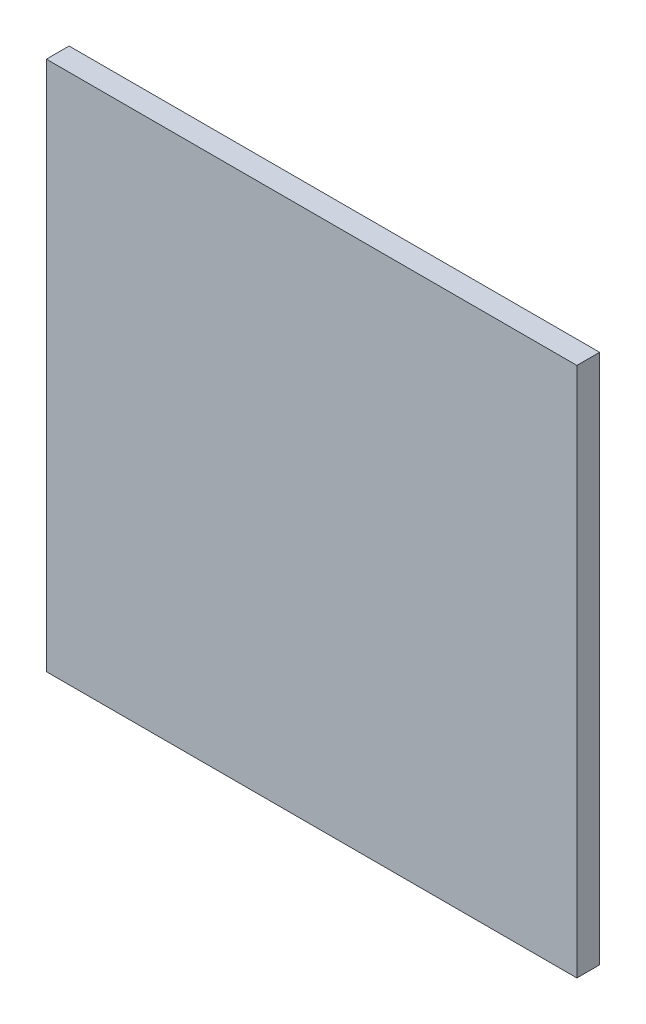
ISO-10303-21;
HEADER;
FILE_DESCRIPTION(('STEP AP214'),'2;1');
FILE_NAME('part.step','',(''),(''),'','','');
FILE_SCHEMA(('AUTOMOTIVE_DESIGN { 1 0 10303 214 1 1 1 1 }'));
ENDSEC;
DATA;
#1=APPLICATION_CONTEXT('core data for automotive mechanical design processes');
#2=APPLICATION_PROTOCOL_DEFINITION('international standard','automotive_design',2000,#1);
#3=PRODUCT_CONTEXT('',#1,'mechanical');
#4=PRODUCT('Part','Part','',(#3));
#5=PRODUCT_RELATED_PRODUCT_CATEGORY('part','',(#4));
#6=PRODUCT_DEFINITION_FORMATION('','',#4);
#7=PRODUCT_DEFINITION_CONTEXT('part definition',#1,'design');
#8=PRODUCT_DEFINITION('design','',#6,#7);
#9=PRODUCT_DEFINITION_SHAPE('','',#8);
#10=(LENGTH_UNIT() NAMED_UNIT(*) SI_UNIT(.MILLI.,.METRE.));
#11=(NAMED_UNIT(*) PLANE_ANGLE_UNIT() SI_UNIT($,.RADIAN.));
#12=(NAMED_UNIT(*) SI_UNIT($,.STERADIAN.) SOLID_ANGLE_UNIT());
#13=UNCERTAINTY_MEASURE_WITH_UNIT(LENGTH_MEASURE(1.E-05),#10,'distance_accuracy_value','');
#14=(GEOMETRIC_REPRESENTATION_CONTEXT(3) GLOBAL_UNCERTAINTY_ASSIGNED_CONTEXT((#13)) GLOBAL_UNIT_ASSIGNED_CONTEXT((#10,
#11,#12)) REPRESENTATION_CONTEXT('',''));
#15=CARTESIAN_POINT('',(0.,0.,0.));
#16=DIRECTION('',(0.,0.,1.));
#17=DIRECTION('',(1.,0.,0.));
#18=AXIS2_PLACEMENT_3D('',#15,#16,#17);
#19=CARTESIAN_POINT('',(35.,35.,3.));
#20=DIRECTION('',(-1.,0.,0.));
#21=DIRECTION('',(0.,-1.,0.));
#22=AXIS2_PLACEMENT_3D('',#19,#20,#21);
#23=PLANE('',#22);
#24=DIRECTION('',(0.,1.,0.));
#25=VECTOR('',#24,1.);
#26=CARTESIAN_POINT('',(35.,35.,0.));
#27=LINE('',#26,#25);
#28=CARTESIAN_POINT('',(35.,-35.,0.));
#29=VERTEX_POINT('',#28);
#30=CARTESIAN_POINT('',(35.,35.,0.));
#31=VERTEX_POINT('',#30);
#32=EDGE_CURVE('E96',#29,#31,#27,.T.);
#33=ORIENTED_EDGE('',*,*,#32,.T.);
#34=DIRECTION('',(0.,0.,-1.));
#35=VECTOR('',#34,1.);
#36=CARTESIAN_POINT('',(35.,35.,3.));
#37=LINE('',#36,#35);
#38=CARTESIAN_POINT('',(35.,35.,3.));
#39=VERTEX_POINT('',#38);
#40=EDGE_CURVE('E11',#39,#31,#37,.T.);
#41=ORIENTED_EDGE('',*,*,#40,.F.);
#42=DIRECTION('',(0.,1.,0.));
#43=VECTOR('',#42,1.);
#44=CARTESIAN_POINT('',(35.,35.,3.));
#45=LINE('',#44,#43);
#46=CARTESIAN_POINT('',(35.,-35.,3.));
#47=VERTEX_POINT('',#46);
#48=EDGE_CURVE('E84',#47,#39,#45,.T.);
#49=ORIENTED_EDGE('',*,*,#48,.F.);
#50=DIRECTION('',(0.,0.,-1.));
#51=VECTOR('',#50,1.);
#52=CARTESIAN_POINT('',(35.,-35.,3.));
#53=LINE('',#52,#51);
#54=EDGE_CURVE('E92',#47,#29,#53,.T.);
#55=ORIENTED_EDGE('',*,*,#54,.T.);
#56=EDGE_LOOP('',(#33,#41,#49,#55));
#57=FACE_BOUND('',#56,.T.);
#58=ADVANCED_FACE('F33',(#57),#23,.F.);
#59=CARTESIAN_POINT('',(-35.,35.,3.));
#60=DIRECTION('',(0.,-1.,0.));
#61=DIRECTION('',(0.,0.,-1.));
#62=AXIS2_PLACEMENT_3D('',#59,#60,#61);
#63=PLANE('',#62);
#64=DIRECTION('',(-1.,0.,0.));
#65=VECTOR('',#64,1.);
#66=CARTESIAN_POINT('',(-35.,35.,0.));
#67=LINE('',#66,#65);
#68=CARTESIAN_POINT('',(-35.,35.,0.));
#69=VERTEX_POINT('',#68);
#70=EDGE_CURVE('E88',#31,#69,#67,.T.);
#71=ORIENTED_EDGE('',*,*,#70,.T.);
#72=DIRECTION('',(0.,0.,-1.));
#73=VECTOR('',#72,1.);
#74=CARTESIAN_POINT('',(-35.,35.,3.));
#75=LINE('',#74,#73);
#76=CARTESIAN_POINT('',(-35.,35.,3.));
#77=VERTEX_POINT('',#76);
#78=EDGE_CURVE('E41',#77,#69,#75,.T.);
#79=ORIENTED_EDGE('',*,*,#78,.F.);
#80=DIRECTION('',(-1.,0.,0.));
#81=VECTOR('',#80,1.);
#82=CARTESIAN_POINT('',(-35.,35.,3.));
#83=LINE('',#82,#81);
#84=EDGE_CURVE('E79',#39,#77,#83,.T.);
#85=ORIENTED_EDGE('',*,*,#84,.F.);
#86=ORIENTED_EDGE('',*,*,#40,.T.);
#87=EDGE_LOOP('',(#71,#79,#85,#86));
#88=FACE_BOUND('',#87,.T.);
#89=ADVANCED_FACE('F87',(#88),#63,.F.);
#90=CARTESIAN_POINT('',(-35.,35.,3.));
#91=DIRECTION('',(1.,0.,0.));
#92=DIRECTION('',(0.,0.,-1.));
#93=AXIS2_PLACEMENT_3D('',#90,#91,#92);
#94=PLANE('',#93);
#95=DIRECTION('',(0.,-1.,0.));
#96=VECTOR('',#95,1.);
#97=CARTESIAN_POINT('',(-35.,35.,0.));
#98=LINE('',#97,#96);
#99=CARTESIAN_POINT('',(-35.,-35.,0.));
#100=VERTEX_POINT('',#99);
#101=EDGE_CURVE('E66',#69,#100,#98,.T.);
#102=ORIENTED_EDGE('',*,*,#101,.T.);
#103=DIRECTION('',(0.,0.,-1.));
#104=VECTOR('',#103,1.);
#105=CARTESIAN_POINT('',(-35.,-35.,3.));
#106=LINE('',#105,#104);
#107=CARTESIAN_POINT('',(-35.,-35.,3.));
#108=VERTEX_POINT('',#107);
#109=EDGE_CURVE('E89',#108,#100,#106,.T.);
#110=ORIENTED_EDGE('',*,*,#109,.F.);
#111=DIRECTION('',(0.,-1.,0.));
#112=VECTOR('',#111,1.);
#113=CARTESIAN_POINT('',(-35.,35.,3.));
#114=LINE('',#113,#112);
#115=EDGE_CURVE('E82',#77,#108,#114,.T.);
#116=ORIENTED_EDGE('',*,*,#115,.F.);
#117=ORIENTED_EDGE('',*,*,#78,.T.);
#118=EDGE_LOOP('',(#102,#110,#116,#117));
#119=FACE_BOUND('',#118,.T.);
#120=ADVANCED_FACE('F90',(#119),#94,.F.);
#121=CARTESIAN_POINT('',(-35.,-35.,3.));
#122=DIRECTION('',(0.,1.,0.));
#123=DIRECTION('',(0.,0.,1.));
#124=AXIS2_PLACEMENT_3D('',#121,#122,#123);
#125=PLANE('',#124);
#126=DIRECTION('',(1.,0.,0.));
#127=VECTOR('',#126,1.);
#128=CARTESIAN_POINT('',(-35.,-35.,0.));
#129=LINE('',#128,#127);
#130=EDGE_CURVE('E72',#100,#29,#129,.T.);
#131=ORIENTED_EDGE('',*,*,#130,.T.);
#132=ORIENTED_EDGE('',*,*,#54,.F.);
#133=DIRECTION('',(1.,0.,0.));
#134=VECTOR('',#133,1.);
#135=CARTESIAN_POINT('',(-35.,-35.,3.));
#136=LINE('',#135,#134);
#137=EDGE_CURVE('E49',#108,#47,#136,.T.);
#138=ORIENTED_EDGE('',*,*,#137,.F.);
#139=ORIENTED_EDGE('',*,*,#109,.T.);
#140=EDGE_LOOP('',(#131,#132,#138,#139));
#141=FACE_BOUND('',#140,.T.);
#142=ADVANCED_FACE('F103',(#141),#125,.F.);
#143=CARTESIAN_POINT('',(0.,0.,3.));
#144=DIRECTION('',(0.,0.,1.));
#145=DIRECTION('',(1.,0.,0.));
#146=AXIS2_PLACEMENT_3D('',#143,#144,#145);
#147=PLANE('',#146);
#148=ORIENTED_EDGE('',*,*,#48,.T.);
#149=ORIENTED_EDGE('',*,*,#84,.T.);
#150=ORIENTED_EDGE('',*,*,#115,.T.);
#151=ORIENTED_EDGE('',*,*,#137,.T.);
#152=EDGE_LOOP('',(#148,#149,#150,#151));
#153=FACE_BOUND('',#152,.T.);
#154=ADVANCED_FACE('F80',(#153),#147,.T.);
#155=CARTESIAN_POINT('',(0.,0.,0.));
#156=DIRECTION('',(0.,0.,1.));
#157=DIRECTION('',(1.,0.,0.));
#158=AXIS2_PLACEMENT_3D('',#155,#156,#157);
#159=PLANE('',#158);
#160=ORIENTED_EDGE('',*,*,#32,.F.);
#161=ORIENTED_EDGE('',*,*,#130,.F.);
#162=ORIENTED_EDGE('',*,*,#101,.F.);
#163=ORIENTED_EDGE('',*,*,#70,.F.);
#164=EDGE_LOOP('',(#160,#161,#162,#163));
#165=FACE_BOUND('',#164,.T.);
#166=ADVANCED_FACE('F106',(#165),#159,.F.);
#167=CLOSED_SHELL('',(#58,#89,#120,#142,#154,#166));
#168=MANIFOLD_SOLID_BREP('B2',#167);
#169=ADVANCED_BREP_SHAPE_REPRESENTATION('',(#18,#168),#14);
#170=SHAPE_DEFINITION_REPRESENTATION(#9,#169);
ENDSEC;
END-ISO-10303-21;
